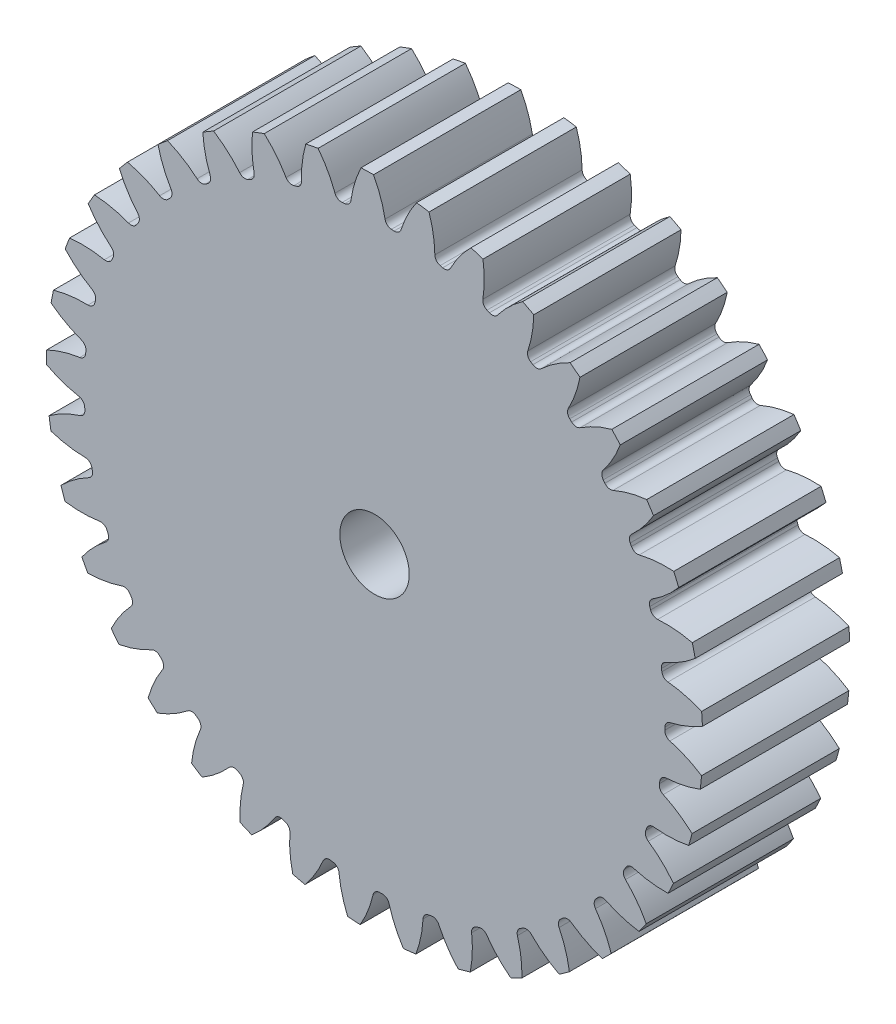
from build123d import *

# Parameters (mm, degrees)
SKETCH3_R         = 198.12
GEARBODY_DEPTH    = 88.9
TOOTHCUT_DEPTH    = 294.949449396
CIRPATTERN1_COUNT = 37
BOREDIA_R         = 20.955
BORE_DEPTH        = 12700


with BuildPart() as part:
    # Sketch3 → gearBody (new body)
    with BuildSketch(Plane.XY):
        Circle(SKETCH3_R)
    extrude(amount=GEARBODY_DEPTH)

    # Sketch2 → toothCut (cut, through all)
    with BuildSketch(Plane.XY):
        with BuildLine():
            ThreePointArc((175.205400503, -4.374383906), (175.223751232, -3.564351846), (175.238356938, -2.754243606))
            ThreePointArc((175.238356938, -2.754243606), (176.158210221, -0.21835085), (178.446161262, 1.210691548))
            ThreePointArc((178.446161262, 1.210691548), (188.592844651, 4.396159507), (198.12, 9.122225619))
            ThreePointArc((198.12, 9.122225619), (198.288880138, -4.033536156), (197.585139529, -17.171547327))
            ThreePointArc((197.585139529, -17.171547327), (188.258058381, -12.061953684), (178.249310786, -8.466489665))
            ThreePointArc((178.249310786, -8.466489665), (176.021366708, -6.94558621), (175.205400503, -4.374383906))
        make_face()
    toothcut = extrude(amount=TOOTHCUT_DEPTH, mode=Mode.SUBTRACT)

    # CirPattern1: toothCut ×37 about axis
    cirpattern1_axis = Axis((0, 0, 0), (0, 0, 1))
    for i in range(1, CIRPATTERN1_COUNT):
        add(toothcut.rotate(cirpattern1_axis, i * 360 / CIRPATTERN1_COUNT), mode=Mode.SUBTRACT)

    # boreDia → bore (cut, symmetric)
    with BuildSketch(Plane.XY):
        Circle(BOREDIA_R)
    extrude(amount=BORE_DEPTH, both=True, mode=Mode.SUBTRACT)


solid = part.part
